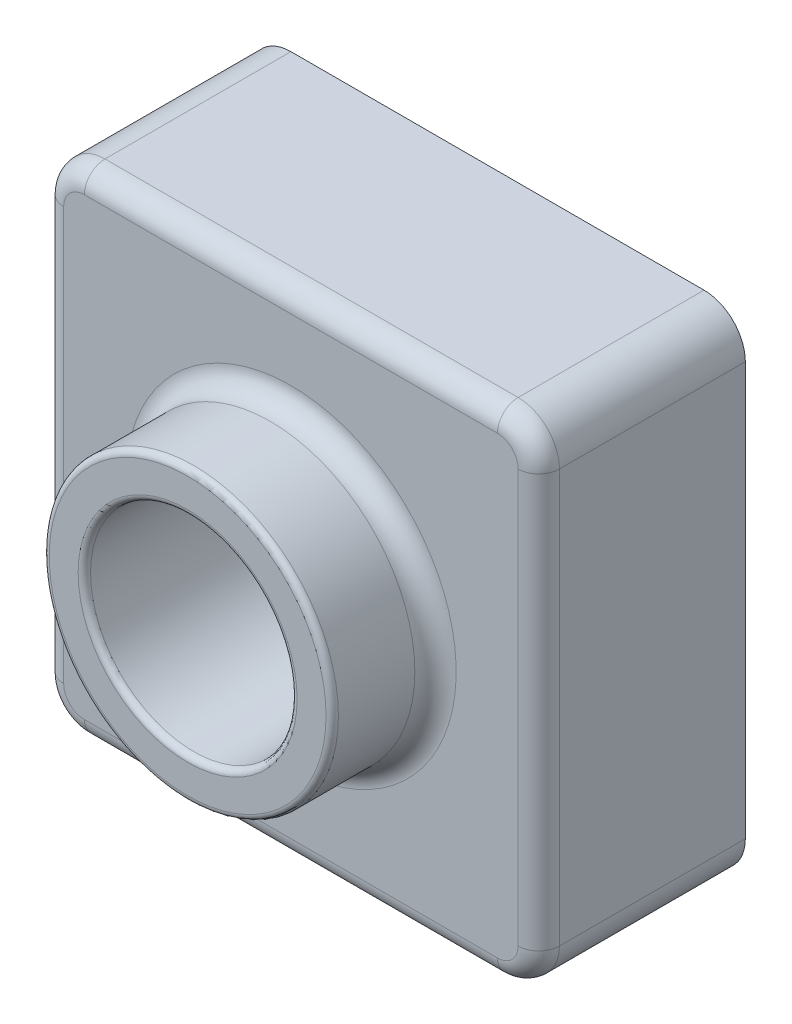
ISO-10303-21;
HEADER;
FILE_DESCRIPTION(('STEP AP214'),'2;1');
FILE_NAME('part.step','',(''),(''),'','','');
FILE_SCHEMA(('AUTOMOTIVE_DESIGN { 1 0 10303 214 1 1 1 1 }'));
ENDSEC;
DATA;
#1=APPLICATION_CONTEXT('core data for automotive mechanical design processes');
#2=APPLICATION_PROTOCOL_DEFINITION('international standard','automotive_design',2000,#1);
#3=PRODUCT_CONTEXT('',#1,'mechanical');
#4=PRODUCT('Part','Part','',(#3));
#5=PRODUCT_RELATED_PRODUCT_CATEGORY('part','',(#4));
#6=PRODUCT_DEFINITION_FORMATION('','',#4);
#7=PRODUCT_DEFINITION_CONTEXT('part definition',#1,'design');
#8=PRODUCT_DEFINITION('design','',#6,#7);
#9=PRODUCT_DEFINITION_SHAPE('','',#8);
#10=(LENGTH_UNIT() NAMED_UNIT(*) SI_UNIT(.MILLI.,.METRE.));
#11=(NAMED_UNIT(*) PLANE_ANGLE_UNIT() SI_UNIT($,.RADIAN.));
#12=(NAMED_UNIT(*) SI_UNIT($,.STERADIAN.) SOLID_ANGLE_UNIT());
#13=UNCERTAINTY_MEASURE_WITH_UNIT(LENGTH_MEASURE(1.E-05),#10,'distance_accuracy_value','');
#14=(GEOMETRIC_REPRESENTATION_CONTEXT(3) GLOBAL_UNCERTAINTY_ASSIGNED_CONTEXT((#13)) GLOBAL_UNIT_ASSIGNED_CONTEXT((#10,
#11,#12)) REPRESENTATION_CONTEXT('',''));
#15=CARTESIAN_POINT('',(0.,0.,0.));
#16=DIRECTION('',(0.,0.,1.));
#17=DIRECTION('',(1.,0.,0.));
#18=AXIS2_PLACEMENT_3D('',#15,#16,#17);
#19=CARTESIAN_POINT('',(0.,120.,0.));
#20=DIRECTION('',(0.,0.,-1.));
#21=DIRECTION('',(-1.,0.,0.));
#22=AXIS2_PLACEMENT_3D('',#19,#20,#21);
#23=PLANE('',#22);
#24=DIRECTION('',(1.,0.,0.));
#25=VECTOR('',#24,1.);
#26=CARTESIAN_POINT('',(0.,0.,0.));
#27=LINE('',#26,#25);
#28=CARTESIAN_POINT('',(10.,0.,0.));
#29=VERTEX_POINT('',#28);
#30=CARTESIAN_POINT('',(110.,0.,0.));
#31=VERTEX_POINT('',#30);
#32=EDGE_CURVE('E327',#29,#31,#27,.T.);
#33=ORIENTED_EDGE('',*,*,#32,.F.);
#34=CARTESIAN_POINT('',(10.,10.,0.));
#35=DIRECTION('',(0.,0.,-1.));
#36=DIRECTION('',(-1.,0.,0.));
#37=AXIS2_PLACEMENT_3D('',#34,#35,#36);
#38=CIRCLE('',#37,10.);
#39=CARTESIAN_POINT('',(0.,10.,0.));
#40=VERTEX_POINT('',#39);
#41=EDGE_CURVE('E347',#29,#40,#38,.T.);
#42=ORIENTED_EDGE('',*,*,#41,.T.);
#43=DIRECTION('',(0.,-1.,0.));
#44=VECTOR('',#43,1.);
#45=CARTESIAN_POINT('',(0.,0.,0.));
#46=LINE('',#45,#44);
#47=CARTESIAN_POINT('',(0.,110.,0.));
#48=VERTEX_POINT('',#47);
#49=EDGE_CURVE('E324',#48,#40,#46,.T.);
#50=ORIENTED_EDGE('',*,*,#49,.F.);
#51=CARTESIAN_POINT('',(9.99999999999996,110.,0.));
#52=DIRECTION('',(0.,0.,-1.));
#53=DIRECTION('',(-1.,0.,0.));
#54=AXIS2_PLACEMENT_3D('',#51,#52,#53);
#55=CIRCLE('',#54,10.);
#56=CARTESIAN_POINT('',(9.99999999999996,120.,0.));
#57=VERTEX_POINT('',#56);
#58=EDGE_CURVE('E341',#48,#57,#55,.T.);
#59=ORIENTED_EDGE('',*,*,#58,.T.);
#60=DIRECTION('',(-1.,0.,0.));
#61=VECTOR('',#60,1.);
#62=CARTESIAN_POINT('',(0.,120.,0.));
#63=LINE('',#62,#61);
#64=CARTESIAN_POINT('',(110.,120.,0.));
#65=VERTEX_POINT('',#64);
#66=EDGE_CURVE('E333',#65,#57,#63,.T.);
#67=ORIENTED_EDGE('',*,*,#66,.F.);
#68=CARTESIAN_POINT('',(110.,110.,0.));
#69=DIRECTION('',(0.,0.,-1.));
#70=DIRECTION('',(-1.,0.,0.));
#71=AXIS2_PLACEMENT_3D('',#68,#69,#70);
#72=CIRCLE('',#71,10.);
#73=CARTESIAN_POINT('',(120.,110.,0.));
#74=VERTEX_POINT('',#73);
#75=EDGE_CURVE('E343',#65,#74,#72,.T.);
#76=ORIENTED_EDGE('',*,*,#75,.T.);
#77=DIRECTION('',(0.,1.,0.));
#78=VECTOR('',#77,1.);
#79=CARTESIAN_POINT('',(120.,0.,0.));
#80=LINE('',#79,#78);
#81=CARTESIAN_POINT('',(120.,10.,0.));
#82=VERTEX_POINT('',#81);
#83=EDGE_CURVE('E330',#82,#74,#80,.T.);
#84=ORIENTED_EDGE('',*,*,#83,.F.);
#85=CARTESIAN_POINT('',(110.,10.,0.));
#86=DIRECTION('',(0.,0.,-1.));
#87=DIRECTION('',(-1.,0.,0.));
#88=AXIS2_PLACEMENT_3D('',#85,#86,#87);
#89=CIRCLE('',#88,10.);
#90=EDGE_CURVE('E345',#82,#31,#89,.T.);
#91=ORIENTED_EDGE('',*,*,#90,.T.);
#92=EDGE_LOOP('',(#33,#42,#50,#59,#67,#76,#84,#91));
#93=FACE_BOUND('',#92,.T.);
#94=CARTESIAN_POINT('',(10.,10.,0.));
#95=DIRECTION('',(0.,0.,-1.));
#96=DIRECTION('',(-1.,0.,0.));
#97=AXIS2_PLACEMENT_3D('',#94,#95,#96);
#98=CIRCLE('',#97,8.);
#99=CARTESIAN_POINT('',(10.,2.,0.));
#100=VERTEX_POINT('',#99);
#101=CARTESIAN_POINT('',(2.,10.,0.));
#102=VERTEX_POINT('',#101);
#103=EDGE_CURVE('E281',#100,#102,#98,.T.);
#104=ORIENTED_EDGE('',*,*,#103,.F.);
#105=DIRECTION('',(1.,0.,0.));
#106=VECTOR('',#105,1.);
#107=CARTESIAN_POINT('',(0.,2.,0.));
#108=LINE('',#107,#106);
#109=CARTESIAN_POINT('',(110.,2.,0.));
#110=VERTEX_POINT('',#109);
#111=EDGE_CURVE('E307',#100,#110,#108,.T.);
#112=ORIENTED_EDGE('',*,*,#111,.T.);
#113=CARTESIAN_POINT('',(110.,10.,0.));
#114=DIRECTION('',(0.,0.,-1.));
#115=DIRECTION('',(-1.,0.,0.));
#116=AXIS2_PLACEMENT_3D('',#113,#114,#115);
#117=CIRCLE('',#116,8.);
#118=CARTESIAN_POINT('',(118.,10.,0.));
#119=VERTEX_POINT('',#118);
#120=EDGE_CURVE('E311',#119,#110,#117,.T.);
#121=ORIENTED_EDGE('',*,*,#120,.F.);
#122=DIRECTION('',(0.,1.,0.));
#123=VECTOR('',#122,1.);
#124=CARTESIAN_POINT('',(118.,120.,0.));
#125=LINE('',#124,#123);
#126=CARTESIAN_POINT('',(118.,110.,0.));
#127=VERTEX_POINT('',#126);
#128=EDGE_CURVE('E49',#119,#127,#125,.T.);
#129=ORIENTED_EDGE('',*,*,#128,.T.);
#130=CARTESIAN_POINT('',(110.,110.,0.));
#131=DIRECTION('',(0.,0.,-1.));
#132=DIRECTION('',(-1.,0.,0.));
#133=AXIS2_PLACEMENT_3D('',#130,#131,#132);
#134=CIRCLE('',#133,8.);
#135=CARTESIAN_POINT('',(110.,118.,0.));
#136=VERTEX_POINT('',#135);
#137=EDGE_CURVE('E315',#136,#127,#134,.T.);
#138=ORIENTED_EDGE('',*,*,#137,.F.);
#139=DIRECTION('',(-1.,0.,0.));
#140=VECTOR('',#139,1.);
#141=CARTESIAN_POINT('',(0.,118.,0.));
#142=LINE('',#141,#140);
#143=CARTESIAN_POINT('',(9.99999999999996,118.,0.));
#144=VERTEX_POINT('',#143);
#145=EDGE_CURVE('E266',#136,#144,#142,.T.);
#146=ORIENTED_EDGE('',*,*,#145,.T.);
#147=CARTESIAN_POINT('',(9.99999999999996,110.,0.));
#148=DIRECTION('',(0.,0.,-1.));
#149=DIRECTION('',(-1.,0.,0.));
#150=AXIS2_PLACEMENT_3D('',#147,#148,#149);
#151=CIRCLE('',#150,8.);
#152=CARTESIAN_POINT('',(1.99999999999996,110.,0.));
#153=VERTEX_POINT('',#152);
#154=EDGE_CURVE('E270',#153,#144,#151,.T.);
#155=ORIENTED_EDGE('',*,*,#154,.F.);
#156=DIRECTION('',(0.,-1.,0.));
#157=VECTOR('',#156,1.);
#158=CARTESIAN_POINT('',(1.99999999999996,120.,0.));
#159=LINE('',#158,#157);
#160=EDGE_CURVE('E306',#153,#102,#159,.T.);
#161=ORIENTED_EDGE('',*,*,#160,.T.);
#162=EDGE_LOOP('',(#104,#112,#121,#129,#138,#146,#155,#161));
#163=FACE_BOUND('',#162,.T.);
#164=ADVANCED_FACE('F32',(#93,#163),#23,.T.);
#165=CARTESIAN_POINT('',(0.,120.,50.));
#166=DIRECTION('',(0.,0.,-1.));
#167=DIRECTION('',(-1.,0.,0.));
#168=AXIS2_PLACEMENT_3D('',#165,#166,#167);
#169=PLANE('',#168);
#170=CARTESIAN_POINT('',(60.,60.,50.));
#171=DIRECTION('',(0.,0.,-1.));
#172=DIRECTION('',(-1.,0.,0.));
#173=AXIS2_PLACEMENT_3D('',#170,#171,#172);
#174=CIRCLE('',#173,40.);
#175=CARTESIAN_POINT('',(19.9999999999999,60.,50.));
#176=VERTEX_POINT('',#175);
#177=EDGE_CURVE('E395',#176,#176,#174,.T.);
#178=ORIENTED_EDGE('',*,*,#177,.T.);
#179=EDGE_LOOP('',(#178));
#180=FACE_BOUND('',#179,.T.);
#181=DIRECTION('',(-1.,0.,0.));
#182=VECTOR('',#181,1.);
#183=CARTESIAN_POINT('',(0.,115.,50.));
#184=LINE('',#183,#182);
#185=CARTESIAN_POINT('',(110.,115.,50.));
#186=VERTEX_POINT('',#185);
#187=CARTESIAN_POINT('',(9.99999999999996,115.,50.));
#188=VERTEX_POINT('',#187);
#189=EDGE_CURVE('E390',#186,#188,#184,.T.);
#190=ORIENTED_EDGE('',*,*,#189,.T.);
#191=CARTESIAN_POINT('',(9.99999999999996,110.,50.));
#192=DIRECTION('',(0.,0.,-1.));
#193=DIRECTION('',(-1.,0.,0.));
#194=AXIS2_PLACEMENT_3D('',#191,#192,#193);
#195=CIRCLE('',#194,5.);
#196=CARTESIAN_POINT('',(4.99999999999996,110.,50.));
#197=VERTEX_POINT('',#196);
#198=EDGE_CURVE('E392',#188,#197,#195,.F.);
#199=ORIENTED_EDGE('',*,*,#198,.T.);
#200=DIRECTION('',(0.,-1.,0.));
#201=VECTOR('',#200,1.);
#202=CARTESIAN_POINT('',(4.99999999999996,120.,50.));
#203=LINE('',#202,#201);
#204=CARTESIAN_POINT('',(5.,10.,50.));
#205=VERTEX_POINT('',#204);
#206=EDGE_CURVE('E378',#197,#205,#203,.T.);
#207=ORIENTED_EDGE('',*,*,#206,.T.);
#208=CARTESIAN_POINT('',(10.,10.,50.));
#209=DIRECTION('',(0.,0.,-1.));
#210=DIRECTION('',(-1.,0.,0.));
#211=AXIS2_PLACEMENT_3D('',#208,#209,#210);
#212=CIRCLE('',#211,5.);
#213=CARTESIAN_POINT('',(10.,5.,50.));
#214=VERTEX_POINT('',#213);
#215=EDGE_CURVE('E380',#205,#214,#212,.F.);
#216=ORIENTED_EDGE('',*,*,#215,.T.);
#217=DIRECTION('',(1.,0.,0.));
#218=VECTOR('',#217,1.);
#219=CARTESIAN_POINT('',(0.,5.,50.));
#220=LINE('',#219,#218);
#221=CARTESIAN_POINT('',(110.,5.,50.));
#222=VERTEX_POINT('',#221);
#223=EDGE_CURVE('E382',#214,#222,#220,.T.);
#224=ORIENTED_EDGE('',*,*,#223,.T.);
#225=CARTESIAN_POINT('',(110.,10.,50.));
#226=DIRECTION('',(0.,0.,-1.));
#227=DIRECTION('',(-1.,0.,0.));
#228=AXIS2_PLACEMENT_3D('',#225,#226,#227);
#229=CIRCLE('',#228,5.);
#230=CARTESIAN_POINT('',(115.,10.,50.));
#231=VERTEX_POINT('',#230);
#232=EDGE_CURVE('E384',#222,#231,#229,.F.);
#233=ORIENTED_EDGE('',*,*,#232,.T.);
#234=DIRECTION('',(0.,1.,0.));
#235=VECTOR('',#234,1.);
#236=CARTESIAN_POINT('',(115.,120.,50.));
#237=LINE('',#236,#235);
#238=CARTESIAN_POINT('',(115.,110.,50.));
#239=VERTEX_POINT('',#238);
#240=EDGE_CURVE('E386',#231,#239,#237,.T.);
#241=ORIENTED_EDGE('',*,*,#240,.T.);
#242=CARTESIAN_POINT('',(110.,110.,50.));
#243=DIRECTION('',(0.,0.,-1.));
#244=DIRECTION('',(-1.,0.,0.));
#245=AXIS2_PLACEMENT_3D('',#242,#243,#244);
#246=CIRCLE('',#245,5.);
#247=EDGE_CURVE('E388',#239,#186,#246,.F.);
#248=ORIENTED_EDGE('',*,*,#247,.T.);
#249=EDGE_LOOP('',(#190,#199,#207,#216,#224,#233,#241,#248));
#250=FACE_BOUND('',#249,.T.);
#251=ADVANCED_FACE('F475',(#180,#250),#169,.F.);
#252=CARTESIAN_POINT('',(0.,0.,50.));
#253=DIRECTION('',(1.,0.,0.));
#254=DIRECTION('',(0.,1.,0.));
#255=AXIS2_PLACEMENT_3D('',#252,#253,#254);
#256=PLANE('',#255);
#257=DIRECTION('',(0.,0.,-1.));
#258=VECTOR('',#257,1.);
#259=CARTESIAN_POINT('',(0.,10.,50.));
#260=LINE('',#259,#258);
#261=CARTESIAN_POINT('',(0.,10.,45.));
#262=VERTEX_POINT('',#261);
#263=EDGE_CURVE('E351',#40,#262,#260,.F.);
#264=ORIENTED_EDGE('',*,*,#263,.T.);
#265=DIRECTION('',(0.,-1.,0.));
#266=VECTOR('',#265,1.);
#267=CARTESIAN_POINT('',(0.,0.,45.));
#268=LINE('',#267,#266);
#269=CARTESIAN_POINT('',(0.,110.,45.));
#270=VERTEX_POINT('',#269);
#271=EDGE_CURVE('E11',#262,#270,#268,.F.);
#272=ORIENTED_EDGE('',*,*,#271,.T.);
#273=DIRECTION('',(0.,0.,-1.));
#274=VECTOR('',#273,1.);
#275=CARTESIAN_POINT('',(0.,110.,50.));
#276=LINE('',#275,#274);
#277=EDGE_CURVE('E349',#270,#48,#276,.T.);
#278=ORIENTED_EDGE('',*,*,#277,.T.);
#279=ORIENTED_EDGE('',*,*,#49,.T.);
#280=EDGE_LOOP('',(#264,#272,#278,#279));
#281=FACE_BOUND('',#280,.T.);
#282=ADVANCED_FACE('F489',(#281),#256,.F.);
#283=CARTESIAN_POINT('',(0.,0.,50.));
#284=DIRECTION('',(0.,1.,0.));
#285=DIRECTION('',(0.,0.,1.));
#286=AXIS2_PLACEMENT_3D('',#283,#284,#285);
#287=PLANE('',#286);
#288=DIRECTION('',(0.,0.,-1.));
#289=VECTOR('',#288,1.);
#290=CARTESIAN_POINT('',(110.,0.,50.));
#291=LINE('',#290,#289);
#292=CARTESIAN_POINT('',(110.,0.,45.));
#293=VERTEX_POINT('',#292);
#294=EDGE_CURVE('E336',#31,#293,#291,.F.);
#295=ORIENTED_EDGE('',*,*,#294,.T.);
#296=DIRECTION('',(1.,0.,0.));
#297=VECTOR('',#296,1.);
#298=CARTESIAN_POINT('',(0.,0.,45.));
#299=LINE('',#298,#297);
#300=CARTESIAN_POINT('',(10.,0.,45.));
#301=VERTEX_POINT('',#300);
#302=EDGE_CURVE('E409',#293,#301,#299,.F.);
#303=ORIENTED_EDGE('',*,*,#302,.T.);
#304=DIRECTION('',(0.,0.,-1.));
#305=VECTOR('',#304,1.);
#306=CARTESIAN_POINT('',(10.,0.,50.));
#307=LINE('',#306,#305);
#308=EDGE_CURVE('E339',#301,#29,#307,.T.);
#309=ORIENTED_EDGE('',*,*,#308,.T.);
#310=ORIENTED_EDGE('',*,*,#32,.T.);
#311=EDGE_LOOP('',(#295,#303,#309,#310));
#312=FACE_BOUND('',#311,.T.);
#313=ADVANCED_FACE('F448',(#312),#287,.F.);
#314=CARTESIAN_POINT('',(120.,0.,50.));
#315=DIRECTION('',(-1.,0.,0.));
#316=DIRECTION('',(0.,-1.,0.));
#317=AXIS2_PLACEMENT_3D('',#314,#315,#316);
#318=PLANE('',#317);
#319=DIRECTION('',(0.,0.,-1.));
#320=VECTOR('',#319,1.);
#321=CARTESIAN_POINT('',(120.,110.,50.));
#322=LINE('',#321,#320);
#323=CARTESIAN_POINT('',(120.,110.,45.));
#324=VERTEX_POINT('',#323);
#325=EDGE_CURVE('E353',#74,#324,#322,.F.);
#326=ORIENTED_EDGE('',*,*,#325,.T.);
#327=DIRECTION('',(0.,1.,0.));
#328=VECTOR('',#327,1.);
#329=CARTESIAN_POINT('',(120.,0.,45.));
#330=LINE('',#329,#328);
#331=CARTESIAN_POINT('',(120.,10.,45.));
#332=VERTEX_POINT('',#331);
#333=EDGE_CURVE('E405',#324,#332,#330,.F.);
#334=ORIENTED_EDGE('',*,*,#333,.T.);
#335=DIRECTION('',(0.,0.,-1.));
#336=VECTOR('',#335,1.);
#337=CARTESIAN_POINT('',(120.,10.,50.));
#338=LINE('',#337,#336);
#339=EDGE_CURVE('E356',#332,#82,#338,.T.);
#340=ORIENTED_EDGE('',*,*,#339,.T.);
#341=ORIENTED_EDGE('',*,*,#83,.T.);
#342=EDGE_LOOP('',(#326,#334,#340,#341));
#343=FACE_BOUND('',#342,.T.);
#344=ADVANCED_FACE('F459',(#343),#318,.F.);
#345=CARTESIAN_POINT('',(0.,120.,50.));
#346=DIRECTION('',(0.,-1.,0.));
#347=DIRECTION('',(0.,0.,-1.));
#348=AXIS2_PLACEMENT_3D('',#345,#346,#347);
#349=PLANE('',#348);
#350=DIRECTION('',(0.,0.,-1.));
#351=VECTOR('',#350,1.);
#352=CARTESIAN_POINT('',(9.99999999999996,120.,50.));
#353=LINE('',#352,#351);
#354=CARTESIAN_POINT('',(9.99999999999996,120.,45.));
#355=VERTEX_POINT('',#354);
#356=EDGE_CURVE('E358',#57,#355,#353,.F.);
#357=ORIENTED_EDGE('',*,*,#356,.T.);
#358=DIRECTION('',(-1.,0.,0.));
#359=VECTOR('',#358,1.);
#360=CARTESIAN_POINT('',(0.,120.,45.));
#361=LINE('',#360,#359);
#362=CARTESIAN_POINT('',(110.,120.,45.));
#363=VERTEX_POINT('',#362);
#364=EDGE_CURVE('E401',#355,#363,#361,.F.);
#365=ORIENTED_EDGE('',*,*,#364,.T.);
#366=DIRECTION('',(0.,0.,-1.));
#367=VECTOR('',#366,1.);
#368=CARTESIAN_POINT('',(110.,120.,50.));
#369=LINE('',#368,#367);
#370=EDGE_CURVE('E361',#363,#65,#369,.T.);
#371=ORIENTED_EDGE('',*,*,#370,.T.);
#372=ORIENTED_EDGE('',*,*,#66,.T.);
#373=EDGE_LOOP('',(#357,#365,#371,#372));
#374=FACE_BOUND('',#373,.T.);
#375=ADVANCED_FACE('F519',(#374),#349,.F.);
#376=CARTESIAN_POINT('',(60.,60.,0.));
#377=DIRECTION('',(0.,0.,-1.));
#378=DIRECTION('',(-1.,0.,0.));
#379=AXIS2_PLACEMENT_3D('',#376,#377,#378);
#380=CIRCLE('',#379,27.);
#381=CARTESIAN_POINT('',(32.9999999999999,60.,0.));
#382=VERTEX_POINT('',#381);
#383=EDGE_CURVE('E261',#382,#382,#380,.F.);
#384=ORIENTED_EDGE('',*,*,#383,.F.);
#385=EDGE_LOOP('',(#384));
#386=FACE_BOUND('',#385,.T.);
#387=CARTESIAN_POINT('',(60.,60.,0.));
#388=DIRECTION('',(0.,0.,1.));
#389=DIRECTION('',(1.,0.,0.));
#390=AXIS2_PLACEMENT_3D('',#387,#388,#389);
#391=CIRCLE('',#390,25.);
#392=CARTESIAN_POINT('',(85.,60.,0.));
#393=VERTEX_POINT('',#392);
#394=EDGE_CURVE('E321',#393,#393,#391,.T.);
#395=ORIENTED_EDGE('',*,*,#394,.T.);
#396=EDGE_LOOP('',(#395));
#397=FACE_BOUND('',#396,.T.);
#398=ADVANCED_FACE('F510',(#386,#397),#23,.T.);
#399=CARTESIAN_POINT('',(60.,60.,75.));
#400=DIRECTION('',(0.,0.,-1.));
#401=DIRECTION('',(-1.,0.,0.));
#402=AXIS2_PLACEMENT_3D('',#399,#400,#401);
#403=CYLINDRICAL_SURFACE('',#402,35.);
#404=CARTESIAN_POINT('',(60.,60.,55.));
#405=DIRECTION('',(0.,0.,-1.));
#406=DIRECTION('',(-1.,0.,0.));
#407=AXIS2_PLACEMENT_3D('',#404,#405,#406);
#408=CIRCLE('',#407,35.);
#409=CARTESIAN_POINT('',(24.9999999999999,60.,55.));
#410=VERTEX_POINT('',#409);
#411=EDGE_CURVE('E375',#410,#410,#408,.F.);
#412=ORIENTED_EDGE('',*,*,#411,.T.);
#413=EDGE_LOOP('',(#412));
#414=FACE_BOUND('',#413,.T.);
#415=CARTESIAN_POINT('',(60.,60.,73.5));
#416=DIRECTION('',(0.,0.,1.));
#417=DIRECTION('',(1.,0.,0.));
#418=AXIS2_PLACEMENT_3D('',#415,#416,#417);
#419=CIRCLE('',#418,35.);
#420=CARTESIAN_POINT('',(95.,60.,73.5));
#421=VERTEX_POINT('',#420);
#422=EDGE_CURVE('E369',#421,#421,#419,.F.);
#423=ORIENTED_EDGE('',*,*,#422,.T.);
#424=EDGE_LOOP('',(#423));
#425=FACE_BOUND('',#424,.T.);
#426=ADVANCED_FACE('F518',(#414,#425),#403,.T.);
#427=CARTESIAN_POINT('',(60.,60.,75.));
#428=DIRECTION('',(0.,0.,1.));
#429=DIRECTION('',(1.,0.,0.));
#430=AXIS2_PLACEMENT_3D('',#427,#428,#429);
#431=PLANE('',#430);
#432=CARTESIAN_POINT('',(60.,60.,75.));
#433=DIRECTION('',(0.,0.,1.));
#434=DIRECTION('',(1.,0.,0.));
#435=AXIS2_PLACEMENT_3D('',#432,#433,#434);
#436=CIRCLE('',#435,33.5);
#437=CARTESIAN_POINT('',(93.5,60.,75.));
#438=VERTEX_POINT('',#437);
#439=EDGE_CURVE('E366',#438,#438,#436,.T.);
#440=ORIENTED_EDGE('',*,*,#439,.T.);
#441=EDGE_LOOP('',(#440));
#442=FACE_BOUND('',#441,.T.);
#443=CARTESIAN_POINT('',(60.,60.,75.));
#444=DIRECTION('',(0.,0.,1.));
#445=DIRECTION('',(1.,0.,0.));
#446=AXIS2_PLACEMENT_3D('',#443,#444,#445);
#447=CIRCLE('',#446,26.5);
#448=CARTESIAN_POINT('',(86.5,60.,75.));
#449=VERTEX_POINT('',#448);
#450=EDGE_CURVE('E363',#449,#449,#447,.F.);
#451=ORIENTED_EDGE('',*,*,#450,.T.);
#452=EDGE_LOOP('',(#451));
#453=FACE_BOUND('',#452,.T.);
#454=ADVANCED_FACE('F525',(#442,#453),#431,.T.);
#455=CARTESIAN_POINT('',(60.,60.,0.));
#456=DIRECTION('',(0.,0.,1.));
#457=DIRECTION('',(1.,0.,0.));
#458=AXIS2_PLACEMENT_3D('',#455,#456,#457);
#459=CYLINDRICAL_SURFACE('',#458,25.);
#460=CARTESIAN_POINT('',(60.,60.,73.5));
#461=DIRECTION('',(0.,0.,1.));
#462=DIRECTION('',(1.,0.,0.));
#463=AXIS2_PLACEMENT_3D('',#460,#461,#462);
#464=CIRCLE('',#463,25.);
#465=CARTESIAN_POINT('',(85.,60.,73.5));
#466=VERTEX_POINT('',#465);
#467=EDGE_CURVE('E372',#466,#466,#464,.T.);
#468=ORIENTED_EDGE('',*,*,#467,.T.);
#469=EDGE_LOOP('',(#468));
#470=FACE_BOUND('',#469,.T.);
#471=ORIENTED_EDGE('',*,*,#394,.F.);
#472=EDGE_LOOP('',(#471));
#473=FACE_BOUND('',#472,.T.);
#474=ADVANCED_FACE('F533',(#470,#473),#459,.F.);
#475=CARTESIAN_POINT('',(10.,10.,50.));
#476=DIRECTION('',(0.,0.,-1.));
#477=DIRECTION('',(-1.,0.,0.));
#478=AXIS2_PLACEMENT_3D('',#475,#476,#477);
#479=CYLINDRICAL_SURFACE('',#478,10.);
#480=ORIENTED_EDGE('',*,*,#308,.F.);
#481=CARTESIAN_POINT('',(10.,10.,45.));
#482=DIRECTION('',(0.,0.,-1.));
#483=DIRECTION('',(-1.,0.,0.));
#484=AXIS2_PLACEMENT_3D('',#481,#482,#483);
#485=CIRCLE('',#484,10.);
#486=EDGE_CURVE('E41',#301,#262,#485,.T.);
#487=ORIENTED_EDGE('',*,*,#486,.T.);
#488=ORIENTED_EDGE('',*,*,#263,.F.);
#489=ORIENTED_EDGE('',*,*,#41,.F.);
#490=EDGE_LOOP('',(#480,#487,#488,#489));
#491=FACE_BOUND('',#490,.T.);
#492=ADVANCED_FACE('F535',(#491),#479,.T.);
#493=CARTESIAN_POINT('',(110.,10.,50.));
#494=DIRECTION('',(0.,0.,-1.));
#495=DIRECTION('',(-1.,0.,0.));
#496=AXIS2_PLACEMENT_3D('',#493,#494,#495);
#497=CYLINDRICAL_SURFACE('',#496,10.);
#498=ORIENTED_EDGE('',*,*,#339,.F.);
#499=CARTESIAN_POINT('',(110.,10.,45.));
#500=DIRECTION('',(0.,0.,-1.));
#501=DIRECTION('',(-1.,0.,0.));
#502=AXIS2_PLACEMENT_3D('',#499,#500,#501);
#503=CIRCLE('',#502,10.);
#504=EDGE_CURVE('E407',#332,#293,#503,.T.);
#505=ORIENTED_EDGE('',*,*,#504,.T.);
#506=ORIENTED_EDGE('',*,*,#294,.F.);
#507=ORIENTED_EDGE('',*,*,#90,.F.);
#508=EDGE_LOOP('',(#498,#505,#506,#507));
#509=FACE_BOUND('',#508,.T.);
#510=ADVANCED_FACE('F445',(#509),#497,.T.);
#511=CARTESIAN_POINT('',(110.,110.,50.));
#512=DIRECTION('',(0.,0.,-1.));
#513=DIRECTION('',(-1.,0.,0.));
#514=AXIS2_PLACEMENT_3D('',#511,#512,#513);
#515=CYLINDRICAL_SURFACE('',#514,10.);
#516=ORIENTED_EDGE('',*,*,#370,.F.);
#517=CARTESIAN_POINT('',(110.,110.,45.));
#518=DIRECTION('',(0.,0.,-1.));
#519=DIRECTION('',(-1.,0.,0.));
#520=AXIS2_PLACEMENT_3D('',#517,#518,#519);
#521=CIRCLE('',#520,10.);
#522=EDGE_CURVE('E403',#363,#324,#521,.T.);
#523=ORIENTED_EDGE('',*,*,#522,.T.);
#524=ORIENTED_EDGE('',*,*,#325,.F.);
#525=ORIENTED_EDGE('',*,*,#75,.F.);
#526=EDGE_LOOP('',(#516,#523,#524,#525));
#527=FACE_BOUND('',#526,.T.);
#528=ADVANCED_FACE('F462',(#527),#515,.T.);
#529=CARTESIAN_POINT('',(9.99999999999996,110.,50.));
#530=DIRECTION('',(0.,0.,-1.));
#531=DIRECTION('',(-1.,0.,0.));
#532=AXIS2_PLACEMENT_3D('',#529,#530,#531);
#533=CYLINDRICAL_SURFACE('',#532,10.);
#534=ORIENTED_EDGE('',*,*,#277,.F.);
#535=CARTESIAN_POINT('',(9.99999999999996,110.,45.));
#536=DIRECTION('',(0.,0.,-1.));
#537=DIRECTION('',(-1.,0.,0.));
#538=AXIS2_PLACEMENT_3D('',#535,#536,#537);
#539=CIRCLE('',#538,10.);
#540=EDGE_CURVE('E398',#270,#355,#539,.T.);
#541=ORIENTED_EDGE('',*,*,#540,.T.);
#542=ORIENTED_EDGE('',*,*,#356,.F.);
#543=ORIENTED_EDGE('',*,*,#58,.F.);
#544=EDGE_LOOP('',(#534,#541,#542,#543));
#545=FACE_BOUND('',#544,.T.);
#546=ADVANCED_FACE('F493',(#545),#533,.T.);
#547=CARTESIAN_POINT('',(60.,60.,73.5));
#548=DIRECTION('',(0.,0.,1.));
#549=DIRECTION('',(1.,0.,0.));
#550=AXIS2_PLACEMENT_3D('',#547,#548,#549);
#551=TOROIDAL_SURFACE('',#550,33.5,1.5);
#552=ORIENTED_EDGE('',*,*,#422,.F.);
#553=EDGE_LOOP('',(#552));
#554=FACE_BOUND('',#553,.T.);
#555=ORIENTED_EDGE('',*,*,#439,.F.);
#556=EDGE_LOOP('',(#555));
#557=FACE_BOUND('',#556,.T.);
#558=ADVANCED_FACE('F857',(#554,#557),#551,.T.);
#559=CARTESIAN_POINT('',(60.,60.,73.5));
#560=DIRECTION('',(0.,0.,1.));
#561=DIRECTION('',(1.,0.,0.));
#562=AXIS2_PLACEMENT_3D('',#559,#560,#561);
#563=TOROIDAL_SURFACE('',#562,26.5,1.5);
#564=ORIENTED_EDGE('',*,*,#450,.F.);
#565=EDGE_LOOP('',(#564));
#566=FACE_BOUND('',#565,.T.);
#567=ORIENTED_EDGE('',*,*,#467,.F.);
#568=EDGE_LOOP('',(#567));
#569=FACE_BOUND('',#568,.T.);
#570=ADVANCED_FACE('F848',(#566,#569),#563,.T.);
#571=CARTESIAN_POINT('',(60.,60.,55.));
#572=DIRECTION('',(0.,0.,-1.));
#573=DIRECTION('',(-1.,0.,0.));
#574=AXIS2_PLACEMENT_3D('',#571,#572,#573);
#575=TOROIDAL_SURFACE('',#574,40.,5.);
#576=ORIENTED_EDGE('',*,*,#177,.F.);
#577=EDGE_LOOP('',(#576));
#578=FACE_BOUND('',#577,.T.);
#579=ORIENTED_EDGE('',*,*,#411,.F.);
#580=EDGE_LOOP('',(#579));
#581=FACE_BOUND('',#580,.T.);
#582=ADVANCED_FACE('F840',(#578,#581),#575,.F.);
#583=CARTESIAN_POINT('',(110.,10.,45.));
#584=DIRECTION('',(0.,0.,-1.));
#585=DIRECTION('',(-1.,0.,0.));
#586=AXIS2_PLACEMENT_3D('',#583,#584,#585);
#587=DEGENERATE_TOROIDAL_SURFACE('',#586,5.,5.,.T.);
#588=CARTESIAN_POINT('',(110.,5.,45.));
#589=DIRECTION('',(-1.,0.,0.));
#590=DIRECTION('',(0.,0.,1.));
#591=AXIS2_PLACEMENT_3D('',#588,#589,#590);
#592=CIRCLE('',#591,5.);
#593=EDGE_CURVE('E426',#293,#222,#592,.T.);
#594=ORIENTED_EDGE('',*,*,#593,.F.);
#595=ORIENTED_EDGE('',*,*,#504,.F.);
#596=CARTESIAN_POINT('',(115.,10.,45.));
#597=DIRECTION('',(0.,1.,0.));
#598=DIRECTION('',(-1.,0.,0.));
#599=AXIS2_PLACEMENT_3D('',#596,#597,#598);
#600=CIRCLE('',#599,5.);
#601=EDGE_CURVE('E36',#231,#332,#600,.T.);
#602=ORIENTED_EDGE('',*,*,#601,.F.);
#603=ORIENTED_EDGE('',*,*,#232,.F.);
#604=EDGE_LOOP('',(#594,#595,#602,#603));
#605=FACE_BOUND('',#604,.T.);
#606=ADVANCED_FACE('F34',(#605),#587,.T.);
#607=CARTESIAN_POINT('',(115.,120.,45.));
#608=DIRECTION('',(0.,1.,0.));
#609=DIRECTION('',(-1.,0.,0.));
#610=AXIS2_PLACEMENT_3D('',#607,#608,#609);
#611=CYLINDRICAL_SURFACE('',#610,5.);
#612=ORIENTED_EDGE('',*,*,#601,.T.);
#613=ORIENTED_EDGE('',*,*,#333,.F.);
#614=CARTESIAN_POINT('',(115.,110.,45.));
#615=DIRECTION('',(0.,1.,0.));
#616=DIRECTION('',(0.,0.,1.));
#617=AXIS2_PLACEMENT_3D('',#614,#615,#616);
#618=CIRCLE('',#617,5.);
#619=EDGE_CURVE('E424',#239,#324,#618,.T.);
#620=ORIENTED_EDGE('',*,*,#619,.F.);
#621=ORIENTED_EDGE('',*,*,#240,.F.);
#622=EDGE_LOOP('',(#612,#613,#620,#621));
#623=FACE_BOUND('',#622,.T.);
#624=ADVANCED_FACE('F437',(#623),#611,.T.);
#625=CARTESIAN_POINT('',(0.,5.,45.));
#626=DIRECTION('',(1.,0.,0.));
#627=DIRECTION('',(0.,0.,-1.));
#628=AXIS2_PLACEMENT_3D('',#625,#626,#627);
#629=CYLINDRICAL_SURFACE('',#628,5.);
#630=ORIENTED_EDGE('',*,*,#593,.T.);
#631=ORIENTED_EDGE('',*,*,#223,.F.);
#632=CARTESIAN_POINT('',(10.,5.,45.));
#633=DIRECTION('',(-1.,0.,0.));
#634=DIRECTION('',(0.,0.,1.));
#635=AXIS2_PLACEMENT_3D('',#632,#633,#634);
#636=CIRCLE('',#635,5.);
#637=EDGE_CURVE('E421',#301,#214,#636,.T.);
#638=ORIENTED_EDGE('',*,*,#637,.F.);
#639=ORIENTED_EDGE('',*,*,#302,.F.);
#640=EDGE_LOOP('',(#630,#631,#638,#639));
#641=FACE_BOUND('',#640,.T.);
#642=ADVANCED_FACE('F478',(#641),#629,.T.);
#643=CARTESIAN_POINT('',(110.,110.,45.));
#644=DIRECTION('',(0.,0.,-1.));
#645=DIRECTION('',(-1.,0.,0.));
#646=AXIS2_PLACEMENT_3D('',#643,#644,#645);
#647=DEGENERATE_TOROIDAL_SURFACE('',#646,5.,5.,.T.);
#648=ORIENTED_EDGE('',*,*,#619,.T.);
#649=ORIENTED_EDGE('',*,*,#522,.F.);
#650=CARTESIAN_POINT('',(110.,115.,45.));
#651=DIRECTION('',(-1.,0.,0.));
#652=DIRECTION('',(0.,0.,1.));
#653=AXIS2_PLACEMENT_3D('',#650,#651,#652);
#654=CIRCLE('',#653,5.);
#655=EDGE_CURVE('E418',#186,#363,#654,.T.);
#656=ORIENTED_EDGE('',*,*,#655,.F.);
#657=ORIENTED_EDGE('',*,*,#247,.F.);
#658=EDGE_LOOP('',(#648,#649,#656,#657));
#659=FACE_BOUND('',#658,.T.);
#660=ADVANCED_FACE('F466',(#659),#647,.T.);
#661=CARTESIAN_POINT('',(10.,10.,45.));
#662=DIRECTION('',(0.,0.,-1.));
#663=DIRECTION('',(-1.,0.,0.));
#664=AXIS2_PLACEMENT_3D('',#661,#662,#663);
#665=DEGENERATE_TOROIDAL_SURFACE('',#664,5.,5.,.T.);
#666=ORIENTED_EDGE('',*,*,#637,.T.);
#667=ORIENTED_EDGE('',*,*,#215,.F.);
#668=CARTESIAN_POINT('',(5.,10.,45.));
#669=DIRECTION('',(0.,1.,0.));
#670=DIRECTION('',(-1.,0.,0.));
#671=AXIS2_PLACEMENT_3D('',#668,#669,#670);
#672=CIRCLE('',#671,5.);
#673=EDGE_CURVE('E415',#262,#205,#672,.T.);
#674=ORIENTED_EDGE('',*,*,#673,.F.);
#675=ORIENTED_EDGE('',*,*,#486,.F.);
#676=EDGE_LOOP('',(#666,#667,#674,#675));
#677=FACE_BOUND('',#676,.T.);
#678=ADVANCED_FACE('F480',(#677),#665,.T.);
#679=CARTESIAN_POINT('',(0.,115.,45.));
#680=DIRECTION('',(-1.,0.,0.));
#681=DIRECTION('',(0.,0.,1.));
#682=AXIS2_PLACEMENT_3D('',#679,#680,#681);
#683=CYLINDRICAL_SURFACE('',#682,5.);
#684=ORIENTED_EDGE('',*,*,#655,.T.);
#685=ORIENTED_EDGE('',*,*,#364,.F.);
#686=CARTESIAN_POINT('',(9.99999999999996,115.,45.));
#687=DIRECTION('',(-1.,0.,0.));
#688=DIRECTION('',(0.,0.,1.));
#689=AXIS2_PLACEMENT_3D('',#686,#687,#688);
#690=CIRCLE('',#689,5.);
#691=EDGE_CURVE('E413',#188,#355,#690,.T.);
#692=ORIENTED_EDGE('',*,*,#691,.F.);
#693=ORIENTED_EDGE('',*,*,#189,.F.);
#694=EDGE_LOOP('',(#684,#685,#692,#693));
#695=FACE_BOUND('',#694,.T.);
#696=ADVANCED_FACE('F471',(#695),#683,.T.);
#697=CARTESIAN_POINT('',(4.99999999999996,120.,45.));
#698=DIRECTION('',(0.,-1.,0.));
#699=DIRECTION('',(1.,0.,0.));
#700=AXIS2_PLACEMENT_3D('',#697,#698,#699);
#701=CYLINDRICAL_SURFACE('',#700,5.);
#702=ORIENTED_EDGE('',*,*,#673,.T.);
#703=ORIENTED_EDGE('',*,*,#206,.F.);
#704=CARTESIAN_POINT('',(4.99999999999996,110.,45.));
#705=DIRECTION('',(0.,1.,0.));
#706=DIRECTION('',(0.,0.,1.));
#707=AXIS2_PLACEMENT_3D('',#704,#705,#706);
#708=CIRCLE('',#707,5.);
#709=EDGE_CURVE('E279',#270,#197,#708,.T.);
#710=ORIENTED_EDGE('',*,*,#709,.F.);
#711=ORIENTED_EDGE('',*,*,#271,.F.);
#712=EDGE_LOOP('',(#702,#703,#710,#711));
#713=FACE_BOUND('',#712,.T.);
#714=ADVANCED_FACE('F486',(#713),#701,.T.);
#715=CARTESIAN_POINT('',(9.99999999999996,110.,45.));
#716=DIRECTION('',(0.,0.,-1.));
#717=DIRECTION('',(-1.,0.,0.));
#718=AXIS2_PLACEMENT_3D('',#715,#716,#717);
#719=DEGENERATE_TOROIDAL_SURFACE('',#718,5.,5.,.T.);
#720=ORIENTED_EDGE('',*,*,#691,.T.);
#721=ORIENTED_EDGE('',*,*,#540,.F.);
#722=ORIENTED_EDGE('',*,*,#709,.T.);
#723=ORIENTED_EDGE('',*,*,#198,.F.);
#724=EDGE_LOOP('',(#720,#721,#722,#723));
#725=FACE_BOUND('',#724,.T.);
#726=ADVANCED_FACE('F496',(#725),#719,.T.);
#727=CARTESIAN_POINT('',(0.,120.,48.));
#728=DIRECTION('',(0.,0.,-1.));
#729=DIRECTION('',(-1.,0.,0.));
#730=AXIS2_PLACEMENT_3D('',#727,#728,#729);
#731=PLANE('',#730);
#732=CARTESIAN_POINT('',(60.,60.,48.));
#733=DIRECTION('',(0.,0.,-1.));
#734=DIRECTION('',(-1.,0.,0.));
#735=AXIS2_PLACEMENT_3D('',#732,#733,#734);
#736=CIRCLE('',#735,40.);
#737=CARTESIAN_POINT('',(19.9999999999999,60.,48.));
#738=VERTEX_POINT('',#737);
#739=EDGE_CURVE('E225',#738,#738,#736,.T.);
#740=ORIENTED_EDGE('',*,*,#739,.F.);
#741=EDGE_LOOP('',(#740));
#742=FACE_BOUND('',#741,.T.);
#743=DIRECTION('',(-1.,0.,0.));
#744=VECTOR('',#743,1.);
#745=CARTESIAN_POINT('',(0.,115.,48.));
#746=LINE('',#745,#744);
#747=CARTESIAN_POINT('',(110.,115.,48.));
#748=VERTEX_POINT('',#747);
#749=CARTESIAN_POINT('',(9.99999999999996,115.,48.));
#750=VERTEX_POINT('',#749);
#751=EDGE_CURVE('E197',#748,#750,#746,.T.);
#752=ORIENTED_EDGE('',*,*,#751,.F.);
#753=CARTESIAN_POINT('',(110.,110.,48.));
#754=DIRECTION('',(0.,0.,-1.));
#755=DIRECTION('',(-1.,0.,0.));
#756=AXIS2_PLACEMENT_3D('',#753,#754,#755);
#757=CIRCLE('',#756,5.);
#758=CARTESIAN_POINT('',(115.,110.,48.));
#759=VERTEX_POINT('',#758);
#760=EDGE_CURVE('E208',#759,#748,#757,.F.);
#761=ORIENTED_EDGE('',*,*,#760,.F.);
#762=DIRECTION('',(0.,1.,0.));
#763=VECTOR('',#762,1.);
#764=CARTESIAN_POINT('',(115.,120.,48.));
#765=LINE('',#764,#763);
#766=CARTESIAN_POINT('',(115.,10.,48.));
#767=VERTEX_POINT('',#766);
#768=EDGE_CURVE('E238',#767,#759,#765,.T.);
#769=ORIENTED_EDGE('',*,*,#768,.F.);
#770=CARTESIAN_POINT('',(110.,10.,48.));
#771=DIRECTION('',(0.,0.,-1.));
#772=DIRECTION('',(-1.,0.,0.));
#773=AXIS2_PLACEMENT_3D('',#770,#771,#772);
#774=CIRCLE('',#773,5.);
#775=CARTESIAN_POINT('',(110.,5.,48.));
#776=VERTEX_POINT('',#775);
#777=EDGE_CURVE('E236',#776,#767,#774,.F.);
#778=ORIENTED_EDGE('',*,*,#777,.F.);
#779=DIRECTION('',(-1.,0.,0.));
#780=VECTOR('',#779,1.);
#781=CARTESIAN_POINT('',(0.,5.,48.));
#782=LINE('',#781,#780);
#783=CARTESIAN_POINT('',(10.,5.,48.));
#784=VERTEX_POINT('',#783);
#785=EDGE_CURVE('E234',#784,#776,#782,.F.);
#786=ORIENTED_EDGE('',*,*,#785,.F.);
#787=CARTESIAN_POINT('',(10.,10.,48.));
#788=DIRECTION('',(0.,0.,-1.));
#789=DIRECTION('',(-1.,0.,0.));
#790=AXIS2_PLACEMENT_3D('',#787,#788,#789);
#791=CIRCLE('',#790,5.);
#792=CARTESIAN_POINT('',(5.,9.99999999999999,48.));
#793=VERTEX_POINT('',#792);
#794=EDGE_CURVE('E231',#793,#784,#791,.F.);
#795=ORIENTED_EDGE('',*,*,#794,.F.);
#796=DIRECTION('',(0.,1.,0.));
#797=VECTOR('',#796,1.);
#798=CARTESIAN_POINT('',(4.99999999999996,120.,48.));
#799=LINE('',#798,#797);
#800=CARTESIAN_POINT('',(4.99999999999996,110.,48.));
#801=VERTEX_POINT('',#800);
#802=EDGE_CURVE('E224',#801,#793,#799,.F.);
#803=ORIENTED_EDGE('',*,*,#802,.F.);
#804=CARTESIAN_POINT('',(9.99999999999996,110.,48.));
#805=DIRECTION('',(0.,0.,-1.));
#806=DIRECTION('',(-1.,0.,0.));
#807=AXIS2_PLACEMENT_3D('',#804,#805,#806);
#808=CIRCLE('',#807,5.);
#809=EDGE_CURVE('E207',#750,#801,#808,.F.);
#810=ORIENTED_EDGE('',*,*,#809,.F.);
#811=EDGE_LOOP('',(#752,#761,#769,#778,#786,#795,#803,#810));
#812=FACE_BOUND('',#811,.T.);
#813=ADVANCED_FACE('F222',(#742,#812),#731,.T.);
#814=CARTESIAN_POINT('',(2.,0.,50.));
#815=DIRECTION('',(1.,0.,0.));
#816=DIRECTION('',(0.,1.,0.));
#817=AXIS2_PLACEMENT_3D('',#814,#815,#816);
#818=PLANE('',#817);
#819=DIRECTION('',(0.,0.,1.));
#820=VECTOR('',#819,1.);
#821=CARTESIAN_POINT('',(2.,10.,50.));
#822=LINE('',#821,#820);
#823=CARTESIAN_POINT('',(2.,10.,45.));
#824=VERTEX_POINT('',#823);
#825=EDGE_CURVE('E273',#102,#824,#822,.T.);
#826=ORIENTED_EDGE('',*,*,#825,.F.);
#827=ORIENTED_EDGE('',*,*,#160,.F.);
#828=DIRECTION('',(0.,0.,1.));
#829=VECTOR('',#828,1.);
#830=CARTESIAN_POINT('',(1.99999999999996,110.,50.));
#831=LINE('',#830,#829);
#832=CARTESIAN_POINT('',(1.99999999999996,110.,45.));
#833=VERTEX_POINT('',#832);
#834=EDGE_CURVE('E277',#833,#153,#831,.F.);
#835=ORIENTED_EDGE('',*,*,#834,.F.);
#836=DIRECTION('',(0.,1.,0.));
#837=VECTOR('',#836,1.);
#838=CARTESIAN_POINT('',(2.,0.,45.));
#839=LINE('',#838,#837);
#840=EDGE_CURVE('E272',#824,#833,#839,.T.);
#841=ORIENTED_EDGE('',*,*,#840,.F.);
#842=EDGE_LOOP('',(#826,#827,#835,#841));
#843=FACE_BOUND('',#842,.T.);
#844=ADVANCED_FACE('F503',(#843),#818,.T.);
#845=CARTESIAN_POINT('',(0.,2.,50.));
#846=DIRECTION('',(0.,1.,0.));
#847=DIRECTION('',(0.,0.,1.));
#848=AXIS2_PLACEMENT_3D('',#845,#846,#847);
#849=PLANE('',#848);
#850=DIRECTION('',(0.,0.,1.));
#851=VECTOR('',#850,1.);
#852=CARTESIAN_POINT('',(110.,2.,50.));
#853=LINE('',#852,#851);
#854=CARTESIAN_POINT('',(110.,2.,45.));
#855=VERTEX_POINT('',#854);
#856=EDGE_CURVE('E262',#110,#855,#853,.T.);
#857=ORIENTED_EDGE('',*,*,#856,.F.);
#858=ORIENTED_EDGE('',*,*,#111,.F.);
#859=DIRECTION('',(0.,0.,1.));
#860=VECTOR('',#859,1.);
#861=CARTESIAN_POINT('',(10.,2.,50.));
#862=LINE('',#861,#860);
#863=CARTESIAN_POINT('',(10.,2.,45.));
#864=VERTEX_POINT('',#863);
#865=EDGE_CURVE('E265',#864,#100,#862,.F.);
#866=ORIENTED_EDGE('',*,*,#865,.F.);
#867=DIRECTION('',(1.,0.,0.));
#868=VECTOR('',#867,1.);
#869=CARTESIAN_POINT('',(0.,2.,45.));
#870=LINE('',#869,#868);
#871=EDGE_CURVE('E257',#855,#864,#870,.F.);
#872=ORIENTED_EDGE('',*,*,#871,.F.);
#873=EDGE_LOOP('',(#857,#858,#866,#872));
#874=FACE_BOUND('',#873,.T.);
#875=ADVANCED_FACE('F613',(#874),#849,.T.);
#876=CARTESIAN_POINT('',(118.,0.,50.));
#877=DIRECTION('',(-1.,0.,0.));
#878=DIRECTION('',(0.,-1.,0.));
#879=AXIS2_PLACEMENT_3D('',#876,#877,#878);
#880=PLANE('',#879);
#881=DIRECTION('',(0.,0.,1.));
#882=VECTOR('',#881,1.);
#883=CARTESIAN_POINT('',(118.,110.,50.));
#884=LINE('',#883,#882);
#885=CARTESIAN_POINT('',(118.,110.,45.));
#886=VERTEX_POINT('',#885);
#887=EDGE_CURVE('E276',#127,#886,#884,.T.);
#888=ORIENTED_EDGE('',*,*,#887,.F.);
#889=ORIENTED_EDGE('',*,*,#128,.F.);
#890=DIRECTION('',(0.,0.,1.));
#891=VECTOR('',#890,1.);
#892=CARTESIAN_POINT('',(118.,10.,50.));
#893=LINE('',#892,#891);
#894=CARTESIAN_POINT('',(118.,10.,45.));
#895=VERTEX_POINT('',#894);
#896=EDGE_CURVE('E286',#895,#119,#893,.F.);
#897=ORIENTED_EDGE('',*,*,#896,.F.);
#898=DIRECTION('',(0.,-1.,0.));
#899=VECTOR('',#898,1.);
#900=CARTESIAN_POINT('',(118.,0.,45.));
#901=LINE('',#900,#899);
#902=EDGE_CURVE('E258',#886,#895,#901,.T.);
#903=ORIENTED_EDGE('',*,*,#902,.F.);
#904=EDGE_LOOP('',(#888,#889,#897,#903));
#905=FACE_BOUND('',#904,.T.);
#906=ADVANCED_FACE('F609',(#905),#880,.T.);
#907=CARTESIAN_POINT('',(0.,118.,50.));
#908=DIRECTION('',(0.,-1.,0.));
#909=DIRECTION('',(0.,0.,-1.));
#910=AXIS2_PLACEMENT_3D('',#907,#908,#909);
#911=PLANE('',#910);
#912=DIRECTION('',(0.,0.,-1.));
#913=VECTOR('',#912,1.);
#914=CARTESIAN_POINT('',(9.99999999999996,118.,50.));
#915=LINE('',#914,#913);
#916=CARTESIAN_POINT('',(9.99999999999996,118.,45.));
#917=VERTEX_POINT('',#916);
#918=EDGE_CURVE('E284',#144,#917,#915,.F.);
#919=ORIENTED_EDGE('',*,*,#918,.F.);
#920=ORIENTED_EDGE('',*,*,#145,.F.);
#921=DIRECTION('',(0.,0.,-1.));
#922=VECTOR('',#921,1.);
#923=CARTESIAN_POINT('',(110.,118.,50.));
#924=LINE('',#923,#922);
#925=CARTESIAN_POINT('',(110.,118.,45.));
#926=VERTEX_POINT('',#925);
#927=EDGE_CURVE('E247',#926,#136,#924,.T.);
#928=ORIENTED_EDGE('',*,*,#927,.F.);
#929=DIRECTION('',(1.,0.,0.));
#930=VECTOR('',#929,1.);
#931=CARTESIAN_POINT('',(0.,118.,45.));
#932=LINE('',#931,#930);
#933=EDGE_CURVE('E283',#917,#926,#932,.T.);
#934=ORIENTED_EDGE('',*,*,#933,.F.);
#935=EDGE_LOOP('',(#919,#920,#928,#934));
#936=FACE_BOUND('',#935,.T.);
#937=ADVANCED_FACE('F605',(#936),#911,.T.);
#938=CARTESIAN_POINT('',(60.,60.,75.));
#939=DIRECTION('',(0.,0.,-1.));
#940=DIRECTION('',(-1.,0.,0.));
#941=AXIS2_PLACEMENT_3D('',#938,#939,#940);
#942=CYLINDRICAL_SURFACE('',#941,33.);
#943=CARTESIAN_POINT('',(60.,60.,55.));
#944=DIRECTION('',(0.,0.,-1.));
#945=DIRECTION('',(-1.,0.,0.));
#946=AXIS2_PLACEMENT_3D('',#943,#944,#945);
#947=CIRCLE('',#946,33.);
#948=CARTESIAN_POINT('',(26.9999999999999,60.,55.));
#949=VERTEX_POINT('',#948);
#950=EDGE_CURVE('E232',#949,#949,#947,.F.);
#951=ORIENTED_EDGE('',*,*,#950,.F.);
#952=EDGE_LOOP('',(#951));
#953=FACE_BOUND('',#952,.T.);
#954=CARTESIAN_POINT('',(60.,60.,73.));
#955=DIRECTION('',(0.,0.,1.));
#956=DIRECTION('',(1.,0.,0.));
#957=AXIS2_PLACEMENT_3D('',#954,#955,#956);
#958=CIRCLE('',#957,33.);
#959=CARTESIAN_POINT('',(93.,60.,73.));
#960=VERTEX_POINT('',#959);
#961=EDGE_CURVE('E244',#960,#960,#958,.T.);
#962=ORIENTED_EDGE('',*,*,#961,.T.);
#963=EDGE_LOOP('',(#962));
#964=FACE_BOUND('',#963,.T.);
#965=ADVANCED_FACE('F601',(#953,#964),#942,.F.);
#966=CARTESIAN_POINT('',(60.,60.,73.));
#967=DIRECTION('',(0.,0.,1.));
#968=DIRECTION('',(1.,0.,0.));
#969=AXIS2_PLACEMENT_3D('',#966,#967,#968);
#970=PLANE('',#969);
#971=ORIENTED_EDGE('',*,*,#961,.F.);
#972=EDGE_LOOP('',(#971));
#973=FACE_BOUND('',#972,.T.);
#974=CARTESIAN_POINT('',(60.,60.,73.));
#975=DIRECTION('',(0.,0.,1.));
#976=DIRECTION('',(1.,0.,0.));
#977=AXIS2_PLACEMENT_3D('',#974,#975,#976);
#978=CIRCLE('',#977,27.);
#979=CARTESIAN_POINT('',(87.,60.,73.));
#980=VERTEX_POINT('',#979);
#981=EDGE_CURVE('E243',#980,#980,#978,.T.);
#982=ORIENTED_EDGE('',*,*,#981,.T.);
#983=EDGE_LOOP('',(#982));
#984=FACE_BOUND('',#983,.T.);
#985=ADVANCED_FACE('F597',(#973,#984),#970,.F.);
#986=CARTESIAN_POINT('',(60.,60.,0.));
#987=DIRECTION('',(0.,0.,1.));
#988=DIRECTION('',(1.,0.,0.));
#989=AXIS2_PLACEMENT_3D('',#986,#987,#988);
#990=CYLINDRICAL_SURFACE('',#989,27.);
#991=ORIENTED_EDGE('',*,*,#981,.F.);
#992=EDGE_LOOP('',(#991));
#993=FACE_BOUND('',#992,.T.);
#994=ORIENTED_EDGE('',*,*,#383,.T.);
#995=EDGE_LOOP('',(#994));
#996=FACE_BOUND('',#995,.T.);
#997=ADVANCED_FACE('F593',(#993,#996),#990,.T.);
#998=CARTESIAN_POINT('',(10.,10.,50.));
#999=DIRECTION('',(0.,0.,-1.));
#1000=DIRECTION('',(-1.,0.,0.));
#1001=AXIS2_PLACEMENT_3D('',#998,#999,#1000);
#1002=CYLINDRICAL_SURFACE('',#1001,8.);
#1003=ORIENTED_EDGE('',*,*,#865,.T.);
#1004=ORIENTED_EDGE('',*,*,#103,.T.);
#1005=ORIENTED_EDGE('',*,*,#825,.T.);
#1006=CARTESIAN_POINT('',(10.,10.,45.));
#1007=DIRECTION('',(0.,0.,-1.));
#1008=DIRECTION('',(-1.,0.,0.));
#1009=AXIS2_PLACEMENT_3D('',#1006,#1007,#1008);
#1010=CIRCLE('',#1009,8.);
#1011=EDGE_CURVE('E268',#864,#824,#1010,.T.);
#1012=ORIENTED_EDGE('',*,*,#1011,.F.);
#1013=EDGE_LOOP('',(#1003,#1004,#1005,#1012));
#1014=FACE_BOUND('',#1013,.T.);
#1015=ADVANCED_FACE('F589',(#1014),#1002,.F.);
#1016=CARTESIAN_POINT('',(110.,10.,50.));
#1017=DIRECTION('',(0.,0.,-1.));
#1018=DIRECTION('',(-1.,0.,0.));
#1019=AXIS2_PLACEMENT_3D('',#1016,#1017,#1018);
#1020=CYLINDRICAL_SURFACE('',#1019,8.);
#1021=ORIENTED_EDGE('',*,*,#896,.T.);
#1022=ORIENTED_EDGE('',*,*,#120,.T.);
#1023=ORIENTED_EDGE('',*,*,#856,.T.);
#1024=CARTESIAN_POINT('',(110.,10.,45.));
#1025=DIRECTION('',(0.,0.,-1.));
#1026=DIRECTION('',(-1.,0.,0.));
#1027=AXIS2_PLACEMENT_3D('',#1024,#1025,#1026);
#1028=CIRCLE('',#1027,8.);
#1029=EDGE_CURVE('E255',#895,#855,#1028,.T.);
#1030=ORIENTED_EDGE('',*,*,#1029,.F.);
#1031=EDGE_LOOP('',(#1021,#1022,#1023,#1030));
#1032=FACE_BOUND('',#1031,.T.);
#1033=ADVANCED_FACE('F585',(#1032),#1020,.F.);
#1034=CARTESIAN_POINT('',(110.,110.,50.));
#1035=DIRECTION('',(0.,0.,-1.));
#1036=DIRECTION('',(-1.,0.,0.));
#1037=AXIS2_PLACEMENT_3D('',#1034,#1035,#1036);
#1038=CYLINDRICAL_SURFACE('',#1037,8.);
#1039=ORIENTED_EDGE('',*,*,#927,.T.);
#1040=ORIENTED_EDGE('',*,*,#137,.T.);
#1041=ORIENTED_EDGE('',*,*,#887,.T.);
#1042=CARTESIAN_POINT('',(110.,110.,45.));
#1043=DIRECTION('',(0.,0.,-1.));
#1044=DIRECTION('',(-1.,0.,0.));
#1045=AXIS2_PLACEMENT_3D('',#1042,#1043,#1044);
#1046=CIRCLE('',#1045,8.);
#1047=EDGE_CURVE('E288',#926,#886,#1046,.T.);
#1048=ORIENTED_EDGE('',*,*,#1047,.F.);
#1049=EDGE_LOOP('',(#1039,#1040,#1041,#1048));
#1050=FACE_BOUND('',#1049,.T.);
#1051=ADVANCED_FACE('F581',(#1050),#1038,.F.);
#1052=CARTESIAN_POINT('',(9.99999999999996,110.,50.));
#1053=DIRECTION('',(0.,0.,-1.));
#1054=DIRECTION('',(-1.,0.,0.));
#1055=AXIS2_PLACEMENT_3D('',#1052,#1053,#1054);
#1056=CYLINDRICAL_SURFACE('',#1055,8.);
#1057=ORIENTED_EDGE('',*,*,#834,.T.);
#1058=ORIENTED_EDGE('',*,*,#154,.T.);
#1059=ORIENTED_EDGE('',*,*,#918,.T.);
#1060=CARTESIAN_POINT('',(9.99999999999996,110.,45.));
#1061=DIRECTION('',(0.,0.,-1.));
#1062=DIRECTION('',(-1.,0.,0.));
#1063=AXIS2_PLACEMENT_3D('',#1060,#1061,#1062);
#1064=CIRCLE('',#1063,8.);
#1065=EDGE_CURVE('E216',#833,#917,#1064,.T.);
#1066=ORIENTED_EDGE('',*,*,#1065,.F.);
#1067=EDGE_LOOP('',(#1057,#1058,#1059,#1066));
#1068=FACE_BOUND('',#1067,.T.);
#1069=ADVANCED_FACE('F577',(#1068),#1056,.F.);
#1070=CARTESIAN_POINT('',(60.,60.,55.));
#1071=DIRECTION('',(0.,0.,-1.));
#1072=DIRECTION('',(-1.,0.,0.));
#1073=AXIS2_PLACEMENT_3D('',#1070,#1071,#1072);
#1074=TOROIDAL_SURFACE('',#1073,40.,7.);
#1075=ORIENTED_EDGE('',*,*,#739,.T.);
#1076=EDGE_LOOP('',(#1075));
#1077=FACE_BOUND('',#1076,.T.);
#1078=ORIENTED_EDGE('',*,*,#950,.T.);
#1079=EDGE_LOOP('',(#1078));
#1080=FACE_BOUND('',#1079,.T.);
#1081=ADVANCED_FACE('F573',(#1077,#1080),#1074,.T.);
#1082=CARTESIAN_POINT('',(110.,10.,45.));
#1083=DIRECTION('',(0.,0.,-1.));
#1084=DIRECTION('',(-1.,0.,0.));
#1085=AXIS2_PLACEMENT_3D('',#1082,#1083,#1084);
#1086=TOROIDAL_SURFACE('',#1085,5.,3.);
#1087=CARTESIAN_POINT('',(110.,5.,45.));
#1088=DIRECTION('',(1.,0.,0.));
#1089=DIRECTION('',(0.,0.,-1.));
#1090=AXIS2_PLACEMENT_3D('',#1087,#1088,#1089);
#1091=CIRCLE('',#1090,3.);
#1092=EDGE_CURVE('E250',#855,#776,#1091,.F.);
#1093=ORIENTED_EDGE('',*,*,#1092,.T.);
#1094=ORIENTED_EDGE('',*,*,#777,.T.);
#1095=CARTESIAN_POINT('',(115.,9.99999999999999,45.));
#1096=DIRECTION('',(0.,1.,0.));
#1097=DIRECTION('',(-1.,0.,0.));
#1098=AXIS2_PLACEMENT_3D('',#1095,#1096,#1097);
#1099=CIRCLE('',#1098,3.);
#1100=EDGE_CURVE('E253',#767,#895,#1099,.T.);
#1101=ORIENTED_EDGE('',*,*,#1100,.T.);
#1102=ORIENTED_EDGE('',*,*,#1029,.T.);
#1103=EDGE_LOOP('',(#1093,#1094,#1101,#1102));
#1104=FACE_BOUND('',#1103,.T.);
#1105=ADVANCED_FACE('F569',(#1104),#1086,.F.);
#1106=CARTESIAN_POINT('',(115.,120.,45.));
#1107=DIRECTION('',(0.,1.,0.));
#1108=DIRECTION('',(-1.,0.,0.));
#1109=AXIS2_PLACEMENT_3D('',#1106,#1107,#1108);
#1110=CYLINDRICAL_SURFACE('',#1109,3.);
#1111=ORIENTED_EDGE('',*,*,#1100,.F.);
#1112=ORIENTED_EDGE('',*,*,#768,.T.);
#1113=CARTESIAN_POINT('',(115.,110.,45.));
#1114=DIRECTION('',(0.,1.,0.));
#1115=DIRECTION('',(-1.,0.,0.));
#1116=AXIS2_PLACEMENT_3D('',#1113,#1114,#1115);
#1117=CIRCLE('',#1116,3.);
#1118=EDGE_CURVE('E254',#759,#886,#1117,.T.);
#1119=ORIENTED_EDGE('',*,*,#1118,.T.);
#1120=ORIENTED_EDGE('',*,*,#902,.T.);
#1121=EDGE_LOOP('',(#1111,#1112,#1119,#1120));
#1122=FACE_BOUND('',#1121,.T.);
#1123=ADVANCED_FACE('F565',(#1122),#1110,.F.);
#1124=CARTESIAN_POINT('',(0.,5.,45.));
#1125=DIRECTION('',(1.,0.,0.));
#1126=DIRECTION('',(0.,0.,-1.));
#1127=AXIS2_PLACEMENT_3D('',#1124,#1125,#1126);
#1128=CYLINDRICAL_SURFACE('',#1127,3.);
#1129=ORIENTED_EDGE('',*,*,#1092,.F.);
#1130=ORIENTED_EDGE('',*,*,#871,.T.);
#1131=CARTESIAN_POINT('',(10.,5.,45.));
#1132=DIRECTION('',(1.,0.,0.));
#1133=DIRECTION('',(0.,1.,0.));
#1134=AXIS2_PLACEMENT_3D('',#1131,#1132,#1133);
#1135=CIRCLE('',#1134,3.);
#1136=EDGE_CURVE('E297',#864,#784,#1135,.F.);
#1137=ORIENTED_EDGE('',*,*,#1136,.T.);
#1138=ORIENTED_EDGE('',*,*,#785,.T.);
#1139=EDGE_LOOP('',(#1129,#1130,#1137,#1138));
#1140=FACE_BOUND('',#1139,.T.);
#1141=ADVANCED_FACE('F561',(#1140),#1128,.F.);
#1142=CARTESIAN_POINT('',(110.,110.,45.));
#1143=DIRECTION('',(0.,0.,-1.));
#1144=DIRECTION('',(-1.,0.,0.));
#1145=AXIS2_PLACEMENT_3D('',#1142,#1143,#1144);
#1146=TOROIDAL_SURFACE('',#1145,5.,3.);
#1147=ORIENTED_EDGE('',*,*,#1118,.F.);
#1148=ORIENTED_EDGE('',*,*,#760,.T.);
#1149=CARTESIAN_POINT('',(110.,115.,45.));
#1150=DIRECTION('',(-1.,0.,0.));
#1151=DIRECTION('',(0.,0.,1.));
#1152=AXIS2_PLACEMENT_3D('',#1149,#1150,#1151);
#1153=CIRCLE('',#1152,3.);
#1154=EDGE_CURVE('E203',#748,#926,#1153,.T.);
#1155=ORIENTED_EDGE('',*,*,#1154,.T.);
#1156=ORIENTED_EDGE('',*,*,#1047,.T.);
#1157=EDGE_LOOP('',(#1147,#1148,#1155,#1156));
#1158=FACE_BOUND('',#1157,.T.);
#1159=ADVANCED_FACE('F557',(#1158),#1146,.F.);
#1160=CARTESIAN_POINT('',(10.,10.,45.));
#1161=DIRECTION('',(0.,0.,-1.));
#1162=DIRECTION('',(-1.,0.,0.));
#1163=AXIS2_PLACEMENT_3D('',#1160,#1161,#1162);
#1164=TOROIDAL_SURFACE('',#1163,5.,3.);
#1165=ORIENTED_EDGE('',*,*,#1136,.F.);
#1166=ORIENTED_EDGE('',*,*,#1011,.T.);
#1167=CARTESIAN_POINT('',(5.,9.99999999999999,45.));
#1168=DIRECTION('',(0.,-1.,0.));
#1169=DIRECTION('',(1.,0.,0.));
#1170=AXIS2_PLACEMENT_3D('',#1167,#1168,#1169);
#1171=CIRCLE('',#1170,3.);
#1172=EDGE_CURVE('E218',#824,#793,#1171,.F.);
#1173=ORIENTED_EDGE('',*,*,#1172,.T.);
#1174=ORIENTED_EDGE('',*,*,#794,.T.);
#1175=EDGE_LOOP('',(#1165,#1166,#1173,#1174));
#1176=FACE_BOUND('',#1175,.T.);
#1177=ADVANCED_FACE('F554',(#1176),#1164,.F.);
#1178=CARTESIAN_POINT('',(0.,115.,45.));
#1179=DIRECTION('',(-1.,0.,0.));
#1180=DIRECTION('',(0.,0.,1.));
#1181=AXIS2_PLACEMENT_3D('',#1178,#1179,#1180);
#1182=CYLINDRICAL_SURFACE('',#1181,3.);
#1183=ORIENTED_EDGE('',*,*,#1154,.F.);
#1184=ORIENTED_EDGE('',*,*,#751,.T.);
#1185=CARTESIAN_POINT('',(9.99999999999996,115.,45.));
#1186=DIRECTION('',(-1.,0.,0.));
#1187=DIRECTION('',(0.,-1.,0.));
#1188=AXIS2_PLACEMENT_3D('',#1185,#1186,#1187);
#1189=CIRCLE('',#1188,3.);
#1190=EDGE_CURVE('E200',#750,#917,#1189,.T.);
#1191=ORIENTED_EDGE('',*,*,#1190,.T.);
#1192=ORIENTED_EDGE('',*,*,#933,.T.);
#1193=EDGE_LOOP('',(#1183,#1184,#1191,#1192));
#1194=FACE_BOUND('',#1193,.T.);
#1195=ADVANCED_FACE('F199',(#1194),#1182,.F.);
#1196=CARTESIAN_POINT('',(4.99999999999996,120.,45.));
#1197=DIRECTION('',(0.,-1.,0.));
#1198=DIRECTION('',(1.,0.,0.));
#1199=AXIS2_PLACEMENT_3D('',#1196,#1197,#1198);
#1200=CYLINDRICAL_SURFACE('',#1199,3.);
#1201=ORIENTED_EDGE('',*,*,#1172,.F.);
#1202=ORIENTED_EDGE('',*,*,#840,.T.);
#1203=CARTESIAN_POINT('',(4.99999999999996,110.,45.));
#1204=DIRECTION('',(0.,-1.,0.));
#1205=DIRECTION('',(0.,0.,-1.));
#1206=AXIS2_PLACEMENT_3D('',#1203,#1204,#1205);
#1207=CIRCLE('',#1206,3.);
#1208=EDGE_CURVE('E219',#833,#801,#1207,.F.);
#1209=ORIENTED_EDGE('',*,*,#1208,.T.);
#1210=ORIENTED_EDGE('',*,*,#802,.T.);
#1211=EDGE_LOOP('',(#1201,#1202,#1209,#1210));
#1212=FACE_BOUND('',#1211,.T.);
#1213=ADVANCED_FACE('F548',(#1212),#1200,.F.);
#1214=CARTESIAN_POINT('',(9.99999999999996,110.,45.));
#1215=DIRECTION('',(0.,0.,-1.));
#1216=DIRECTION('',(-1.,0.,0.));
#1217=AXIS2_PLACEMENT_3D('',#1214,#1215,#1216);
#1218=TOROIDAL_SURFACE('',#1217,5.,3.);
#1219=ORIENTED_EDGE('',*,*,#1190,.F.);
#1220=ORIENTED_EDGE('',*,*,#809,.T.);
#1221=ORIENTED_EDGE('',*,*,#1208,.F.);
#1222=ORIENTED_EDGE('',*,*,#1065,.T.);
#1223=EDGE_LOOP('',(#1219,#1220,#1221,#1222));
#1224=FACE_BOUND('',#1223,.T.);
#1225=ADVANCED_FACE('F213',(#1224),#1218,.F.);
#1226=CLOSED_SHELL('',(#164,#251,#282,#313,#344,#375,#398,#426,#454,#474,#492,#510,#528,#546,
#558,#570,#582,#606,#624,#642,#660,#678,#696,#714,#726,#813,#844,#875,#906,#937,#965,#985,#997,
#1015,#1033,#1051,#1069,#1081,#1105,#1123,#1141,#1159,#1177,#1195,#1213,#1225));
#1227=MANIFOLD_SOLID_BREP('B2',#1226);
#1228=ADVANCED_BREP_SHAPE_REPRESENTATION('',(#18,#1227),#14);
#1229=SHAPE_DEFINITION_REPRESENTATION(#9,#1228);
ENDSEC;
END-ISO-10303-21;
